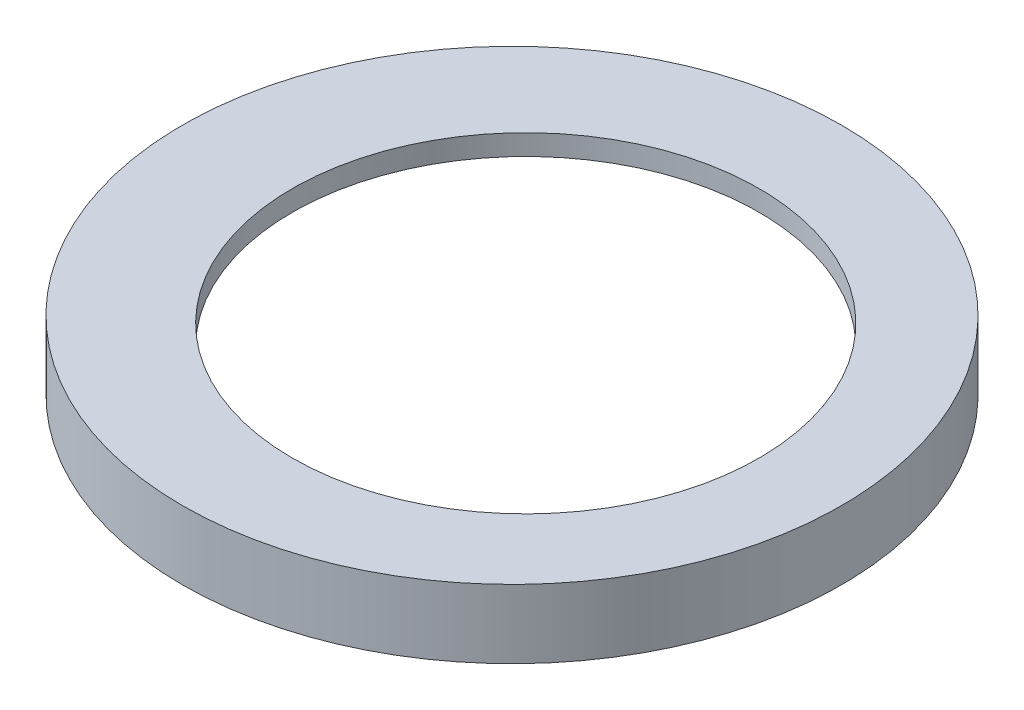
ISO-10303-21;
HEADER;
FILE_DESCRIPTION(('STEP AP214'),'2;1');
FILE_NAME('part.step','',(''),(''),'','','');
FILE_SCHEMA(('AUTOMOTIVE_DESIGN { 1 0 10303 214 1 1 1 1 }'));
ENDSEC;
DATA;
#1=APPLICATION_CONTEXT('core data for automotive mechanical design processes');
#2=APPLICATION_PROTOCOL_DEFINITION('international standard','automotive_design',2000,#1);
#3=PRODUCT_CONTEXT('',#1,'mechanical');
#4=PRODUCT('Part','Part','',(#3));
#5=PRODUCT_RELATED_PRODUCT_CATEGORY('part','',(#4));
#6=PRODUCT_DEFINITION_FORMATION('','',#4);
#7=PRODUCT_DEFINITION_CONTEXT('part definition',#1,'design');
#8=PRODUCT_DEFINITION('design','',#6,#7);
#9=PRODUCT_DEFINITION_SHAPE('','',#8);
#10=(LENGTH_UNIT() NAMED_UNIT(*) SI_UNIT(.MILLI.,.METRE.));
#11=(NAMED_UNIT(*) PLANE_ANGLE_UNIT() SI_UNIT($,.RADIAN.));
#12=(NAMED_UNIT(*) SI_UNIT($,.STERADIAN.) SOLID_ANGLE_UNIT());
#13=UNCERTAINTY_MEASURE_WITH_UNIT(LENGTH_MEASURE(1.E-05),#10,'distance_accuracy_value','');
#14=(GEOMETRIC_REPRESENTATION_CONTEXT(3) GLOBAL_UNCERTAINTY_ASSIGNED_CONTEXT((#13)) GLOBAL_UNIT_ASSIGNED_CONTEXT((#10,
#11,#12)) REPRESENTATION_CONTEXT('',''));
#15=CARTESIAN_POINT('',(0.,0.,0.));
#16=DIRECTION('',(0.,0.,1.));
#17=DIRECTION('',(1.,0.,0.));
#18=AXIS2_PLACEMENT_3D('',#15,#16,#17);
#19=CARTESIAN_POINT('',(-1.,1.5,0.));
#20=DIRECTION('',(0.,1.,0.));
#21=DIRECTION('',(0.,0.,1.));
#22=AXIS2_PLACEMENT_3D('',#19,#20,#21);
#23=PLANE('',#22);
#24=CARTESIAN_POINT('',(0.,1.5,0.));
#25=DIRECTION('',(0.,1.,0.));
#26=DIRECTION('',(0.,0.,1.));
#27=AXIS2_PLACEMENT_3D('',#24,#25,#26);
#28=CIRCLE('',#27,17.);
#29=CARTESIAN_POINT('',(0.,1.5,17.));
#30=VERTEX_POINT('',#29);
#31=EDGE_CURVE('E50',#30,#30,#28,.T.);
#32=ORIENTED_EDGE('',*,*,#31,.F.);
#33=EDGE_LOOP('',(#32));
#34=FACE_BOUND('',#33,.T.);
#35=CARTESIAN_POINT('',(-1.,1.5,0.));
#36=DIRECTION('',(0.,1.,0.));
#37=DIRECTION('',(0.,0.,1.));
#38=AXIS2_PLACEMENT_3D('',#35,#36,#37);
#39=CIRCLE('',#38,24.);
#40=CARTESIAN_POINT('',(-1.,1.5,24.));
#41=VERTEX_POINT('',#40);
#42=EDGE_CURVE('E60',#41,#41,#39,.T.);
#43=ORIENTED_EDGE('',*,*,#42,.T.);
#44=EDGE_LOOP('',(#43));
#45=FACE_BOUND('',#44,.T.);
#46=ADVANCED_FACE('F39',(#34,#45),#23,.T.);
#47=CARTESIAN_POINT('',(-1.,0.,0.));
#48=DIRECTION('',(0.,1.,0.));
#49=DIRECTION('',(0.,0.,1.));
#50=AXIS2_PLACEMENT_3D('',#47,#48,#49);
#51=PLANE('',#50);
#52=CARTESIAN_POINT('',(-22.,0.,0.));
#53=DIRECTION('',(0.,1.,0.));
#54=DIRECTION('',(0.,0.,1.));
#55=AXIS2_PLACEMENT_3D('',#52,#53,#54);
#56=CIRCLE('',#55,1.35);
#57=CARTESIAN_POINT('',(-22.,0.,1.35));
#58=VERTEX_POINT('',#57);
#59=EDGE_CURVE('E10',#58,#58,#56,.F.);
#60=ORIENTED_EDGE('',*,*,#59,.F.);
#61=EDGE_LOOP('',(#60));
#62=FACE_BOUND('',#61,.T.);
#63=CARTESIAN_POINT('',(-1.,0.,0.));
#64=DIRECTION('',(0.,1.,0.));
#65=DIRECTION('',(0.,0.,1.));
#66=AXIS2_PLACEMENT_3D('',#63,#64,#65);
#67=CIRCLE('',#66,23.2);
#68=CARTESIAN_POINT('',(-1.,0.,23.2));
#69=VERTEX_POINT('',#68);
#70=EDGE_CURVE('E46',#69,#69,#67,.T.);
#71=ORIENTED_EDGE('',*,*,#70,.F.);
#72=EDGE_LOOP('',(#71));
#73=FACE_BOUND('',#72,.T.);
#74=CARTESIAN_POINT('',(0.,0.,0.));
#75=DIRECTION('',(0.,1.,0.));
#76=DIRECTION('',(0.,0.,1.));
#77=AXIS2_PLACEMENT_3D('',#74,#75,#76);
#78=CIRCLE('',#77,17.);
#79=CARTESIAN_POINT('',(0.,0.,17.));
#80=VERTEX_POINT('',#79);
#81=EDGE_CURVE('E54',#80,#80,#78,.T.);
#82=ORIENTED_EDGE('',*,*,#81,.T.);
#83=EDGE_LOOP('',(#82));
#84=FACE_BOUND('',#83,.T.);
#85=ADVANCED_FACE('F41',(#62,#73,#84),#51,.F.);
#86=CARTESIAN_POINT('',(0.,1.5,0.));
#87=DIRECTION('',(0.,-1.,0.));
#88=DIRECTION('',(0.,0.,-1.));
#89=AXIS2_PLACEMENT_3D('',#86,#87,#88);
#90=CYLINDRICAL_SURFACE('',#89,17.);
#91=ORIENTED_EDGE('',*,*,#31,.T.);
#92=EDGE_LOOP('',(#91));
#93=FACE_BOUND('',#92,.T.);
#94=ORIENTED_EDGE('',*,*,#81,.F.);
#95=EDGE_LOOP('',(#94));
#96=FACE_BOUND('',#95,.T.);
#97=ADVANCED_FACE('F94',(#93,#96),#90,.F.);
#98=CARTESIAN_POINT('',(-1.,-3.5,0.));
#99=DIRECTION('',(0.,1.,0.));
#100=DIRECTION('',(0.,0.,1.));
#101=AXIS2_PLACEMENT_3D('',#98,#99,#100);
#102=CYLINDRICAL_SURFACE('',#101,23.2);
#103=CARTESIAN_POINT('',(-1.,-3.5,0.));
#104=DIRECTION('',(0.,1.,0.));
#105=DIRECTION('',(0.,0.,1.));
#106=AXIS2_PLACEMENT_3D('',#103,#104,#105);
#107=CIRCLE('',#106,23.2);
#108=CARTESIAN_POINT('',(-1.,-3.5,23.2));
#109=VERTEX_POINT('',#108);
#110=EDGE_CURVE('E63',#109,#109,#107,.T.);
#111=ORIENTED_EDGE('',*,*,#110,.F.);
#112=EDGE_LOOP('',(#111));
#113=FACE_BOUND('',#112,.T.);
#114=ORIENTED_EDGE('',*,*,#70,.T.);
#115=EDGE_LOOP('',(#114));
#116=FACE_BOUND('',#115,.T.);
#117=ADVANCED_FACE('F100',(#113,#116),#102,.F.);
#118=CARTESIAN_POINT('',(-1.,-3.5,0.));
#119=DIRECTION('',(0.,1.,0.));
#120=DIRECTION('',(0.,0.,1.));
#121=AXIS2_PLACEMENT_3D('',#118,#119,#120);
#122=CYLINDRICAL_SURFACE('',#121,24.);
#123=CARTESIAN_POINT('',(-1.,-3.5,0.));
#124=DIRECTION('',(0.,1.,0.));
#125=DIRECTION('',(0.,0.,1.));
#126=AXIS2_PLACEMENT_3D('',#123,#124,#125);
#127=CIRCLE('',#126,24.);
#128=CARTESIAN_POINT('',(-1.,-3.5,24.));
#129=VERTEX_POINT('',#128);
#130=EDGE_CURVE('E58',#129,#129,#127,.T.);
#131=ORIENTED_EDGE('',*,*,#130,.T.);
#132=EDGE_LOOP('',(#131));
#133=FACE_BOUND('',#132,.T.);
#134=ORIENTED_EDGE('',*,*,#42,.F.);
#135=EDGE_LOOP('',(#134));
#136=FACE_BOUND('',#135,.T.);
#137=ADVANCED_FACE('F84',(#133,#136),#122,.T.);
#138=CARTESIAN_POINT('',(-1.,-3.5,0.));
#139=DIRECTION('',(0.,1.,0.));
#140=DIRECTION('',(0.,0.,1.));
#141=AXIS2_PLACEMENT_3D('',#138,#139,#140);
#142=PLANE('',#141);
#143=ORIENTED_EDGE('',*,*,#110,.T.);
#144=EDGE_LOOP('',(#143));
#145=FACE_BOUND('',#144,.T.);
#146=ORIENTED_EDGE('',*,*,#130,.F.);
#147=EDGE_LOOP('',(#146));
#148=FACE_BOUND('',#147,.T.);
#149=ADVANCED_FACE('F76',(#145,#148),#142,.F.);
#150=CARTESIAN_POINT('',(-22.,-0.45,0.));
#151=DIRECTION('',(0.,1.,0.));
#152=DIRECTION('',(0.,0.,1.));
#153=AXIS2_PLACEMENT_3D('',#150,#151,#152);
#154=CYLINDRICAL_SURFACE('',#153,1.35);
#155=CARTESIAN_POINT('',(-22.,-0.45,0.));
#156=DIRECTION('',(0.,-1.,0.));
#157=DIRECTION('',(0.,0.,-1.));
#158=AXIS2_PLACEMENT_3D('',#155,#156,#157);
#159=CIRCLE('',#158,1.35);
#160=CARTESIAN_POINT('',(-22.,-0.45,-1.35));
#161=VERTEX_POINT('',#160);
#162=EDGE_CURVE('E68',#161,#161,#159,.T.);
#163=ORIENTED_EDGE('',*,*,#162,.F.);
#164=EDGE_LOOP('',(#163));
#165=FACE_BOUND('',#164,.T.);
#166=ORIENTED_EDGE('',*,*,#59,.T.);
#167=EDGE_LOOP('',(#166));
#168=FACE_BOUND('',#167,.T.);
#169=ADVANCED_FACE('F74',(#165,#168),#154,.T.);
#170=CARTESIAN_POINT('',(-22.,-0.45,0.));
#171=DIRECTION('',(0.,-1.,0.));
#172=DIRECTION('',(0.,0.,-1.));
#173=AXIS2_PLACEMENT_3D('',#170,#171,#172);
#174=PLANE('',#173);
#175=ORIENTED_EDGE('',*,*,#162,.T.);
#176=EDGE_LOOP('',(#175));
#177=FACE_BOUND('',#176,.T.);
#178=ADVANCED_FACE('F72',(#177),#174,.T.);
#179=CLOSED_SHELL('',(#46,#85,#97,#117,#137,#149,#169,#178));
#180=MANIFOLD_SOLID_BREP('B2',#179);
#181=ADVANCED_BREP_SHAPE_REPRESENTATION('',(#18,#180),#14);
#182=SHAPE_DEFINITION_REPRESENTATION(#9,#181);
ENDSEC;
END-ISO-10303-21;
